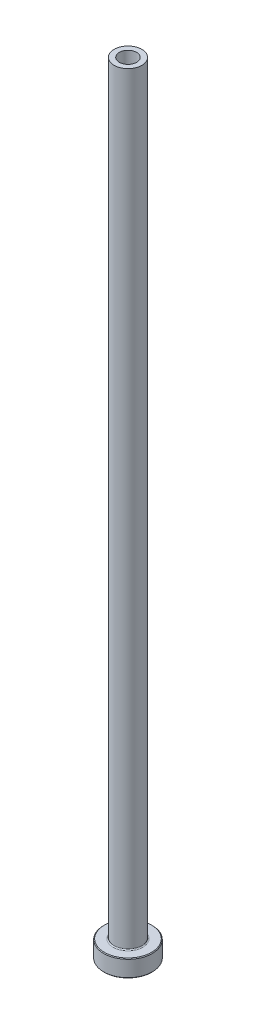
from build123d import *

# Parameters (mm, degrees)
FILLET1_R     = 0.3
CHAMFER1_SIZE = 0.2
CHAMFER3_SIZE = 0.5


with BuildPart() as part:
    # Sketch1 → Revolve1 (revolve)
    with BuildSketch(Plane.XY, mode=Mode.PRIVATE) as revolve1_sk:
        Polygon((-2.5, 225), (-4, 225), (-4, 5), (-7, 5), (-7, 0), (-2.75, 0), (-2.75, 168), (-2.5, 180), align=None)
    revolve(revolve1_sk.sketch.rotate(Axis((0, 92.187680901, 0), (0, -1, 0)), 270), axis=Axis((0, 92.187680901, 0), (0, -1, 0)))

    # Fillet1
    fillet1_edges = [part.edges().sort_by_distance(p)[0] for p in [
        (0, 5, -4),
    ]]
    fillet(fillet1_edges, radius=FILLET1_R)

    # Chamfer1
    chamfer1_edges = [part.edges().sort_by_distance(p)[0] for p in [
        (0, 0, -7),
        (0, 5, -7),
    ]]
    chamfer(chamfer1_edges, length=CHAMFER1_SIZE)

    # Chamfer3
    chamfer3_edges = [part.edges().sort_by_distance(p)[0] for p in [
        (0, 0, -2.75),
    ]]
    chamfer(chamfer3_edges, length=CHAMFER3_SIZE)


solid = part.part
